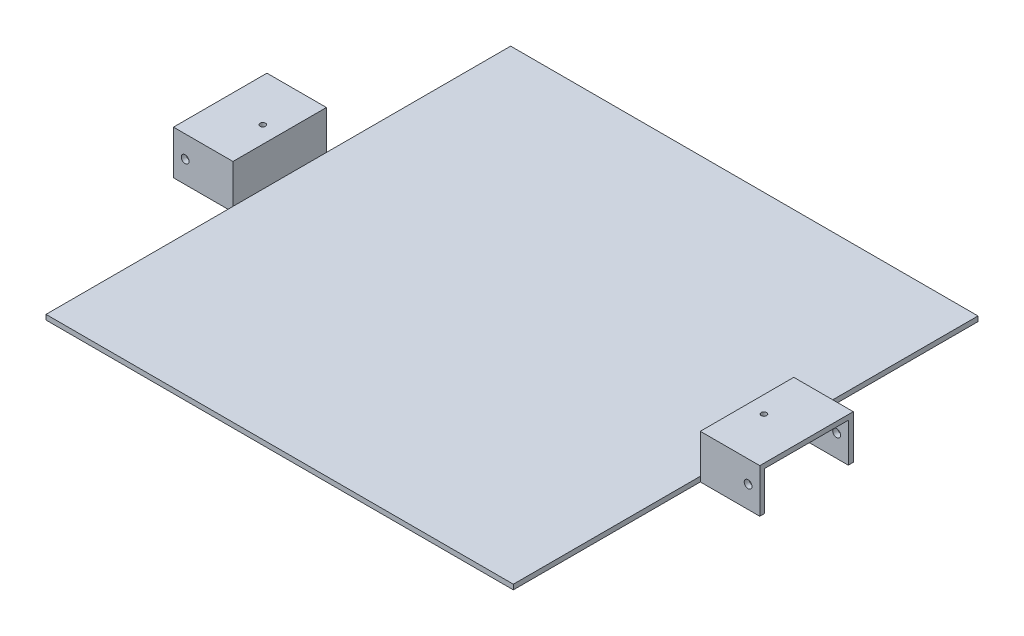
ISO-10303-21;
HEADER;
FILE_DESCRIPTION(('STEP AP214'),'2;1');
FILE_NAME('part.step','',(''),(''),'','','');
FILE_SCHEMA(('AUTOMOTIVE_DESIGN { 1 0 10303 214 1 1 1 1 }'));
ENDSEC;
DATA;
#1=APPLICATION_CONTEXT('core data for automotive mechanical design processes');
#2=APPLICATION_PROTOCOL_DEFINITION('international standard','automotive_design',2000,#1);
#3=PRODUCT_CONTEXT('',#1,'mechanical');
#4=PRODUCT('Part','Part','',(#3));
#5=PRODUCT_RELATED_PRODUCT_CATEGORY('part','',(#4));
#6=PRODUCT_DEFINITION_FORMATION('','',#4);
#7=PRODUCT_DEFINITION_CONTEXT('part definition',#1,'design');
#8=PRODUCT_DEFINITION('design','',#6,#7);
#9=PRODUCT_DEFINITION_SHAPE('','',#8);
#10=(LENGTH_UNIT() NAMED_UNIT(*) SI_UNIT(.MILLI.,.METRE.));
#11=(NAMED_UNIT(*) PLANE_ANGLE_UNIT() SI_UNIT($,.RADIAN.));
#12=(NAMED_UNIT(*) SI_UNIT($,.STERADIAN.) SOLID_ANGLE_UNIT());
#13=UNCERTAINTY_MEASURE_WITH_UNIT(LENGTH_MEASURE(1.E-05),#10,'distance_accuracy_value','');
#14=(GEOMETRIC_REPRESENTATION_CONTEXT(3) GLOBAL_UNCERTAINTY_ASSIGNED_CONTEXT((#13)) GLOBAL_UNIT_ASSIGNED_CONTEXT((#10,
#11,#12)) REPRESENTATION_CONTEXT('',''));
#15=CARTESIAN_POINT('',(0.,0.,0.));
#16=DIRECTION('',(0.,0.,1.));
#17=DIRECTION('',(1.,0.,0.));
#18=AXIS2_PLACEMENT_3D('',#15,#16,#17);
#19=CARTESIAN_POINT('',(306.35,0.,0.));
#20=DIRECTION('',(-1.,0.,0.));
#21=DIRECTION('',(0.,0.,-1.));
#22=AXIS2_PLACEMENT_3D('',#19,#20,#21);
#23=PLANE('',#22);
#24=DIRECTION('',(0.,-1.,0.));
#25=VECTOR('',#24,1.);
#26=CARTESIAN_POINT('',(306.35,43.65,53.65));
#27=LINE('',#26,#25);
#28=CARTESIAN_POINT('',(306.35,43.65,53.65));
#29=VERTEX_POINT('',#28);
#30=CARTESIAN_POINT('',(306.35,-6.34999999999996,53.65));
#31=VERTEX_POINT('',#30);
#32=EDGE_CURVE('E137',#29,#31,#27,.T.);
#33=ORIENTED_EDGE('',*,*,#32,.T.);
#34=DIRECTION('',(0.,0.,1.));
#35=VECTOR('',#34,1.);
#36=CARTESIAN_POINT('',(306.35,-6.34999999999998,-60.));
#37=LINE('',#36,#35);
#38=CARTESIAN_POINT('',(306.35,-6.34999999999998,-53.6499999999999));
#39=VERTEX_POINT('',#38);
#40=EDGE_CURVE('E170',#39,#31,#37,.T.);
#41=ORIENTED_EDGE('',*,*,#40,.F.);
#42=DIRECTION('',(0.,1.,0.));
#43=VECTOR('',#42,1.);
#44=CARTESIAN_POINT('',(306.35,43.65,-53.6499999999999));
#45=LINE('',#44,#43);
#46=CARTESIAN_POINT('',(306.35,43.65,-53.6499999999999));
#47=VERTEX_POINT('',#46);
#48=EDGE_CURVE('E159',#39,#47,#45,.T.);
#49=ORIENTED_EDGE('',*,*,#48,.T.);
#50=DIRECTION('',(0.,0.,1.));
#51=VECTOR('',#50,1.);
#52=CARTESIAN_POINT('',(306.35,43.65,-53.6499999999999));
#53=LINE('',#52,#51);
#54=EDGE_CURVE('E140',#47,#29,#53,.T.);
#55=ORIENTED_EDGE('',*,*,#54,.T.);
#56=EDGE_LOOP('',(#33,#41,#49,#55));
#57=FACE_BOUND('',#56,.T.);
#58=ADVANCED_FACE('F48',(#57),#23,.F.);
#59=CARTESIAN_POINT('',(306.35,-6.34999999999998,-60.));
#60=DIRECTION('',(0.,0.,1.));
#61=DIRECTION('',(-1.,0.,0.));
#62=AXIS2_PLACEMENT_3D('',#59,#60,#61);
#63=PLANE('',#62);
#64=CARTESIAN_POINT('',(361.35,21.825,-59.9999999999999));
#65=DIRECTION('',(0.,0.,1.));
#66=DIRECTION('',(0.,1.,0.));
#67=AXIS2_PLACEMENT_3D('',#64,#65,#66);
#68=CIRCLE('',#67,4.99999999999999);
#69=CARTESIAN_POINT('',(361.35,26.825,-59.9999999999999));
#70=VERTEX_POINT('',#69);
#71=EDGE_CURVE('E256',#70,#70,#68,.T.);
#72=ORIENTED_EDGE('',*,*,#71,.T.);
#73=EDGE_LOOP('',(#72));
#74=FACE_BOUND('',#73,.T.);
#75=DIRECTION('',(0.,-1.,0.));
#76=VECTOR('',#75,1.);
#77=CARTESIAN_POINT('',(300.,-6.34999999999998,-60.));
#78=LINE('',#77,#76);
#79=CARTESIAN_POINT('',(300.,50.,-60.));
#80=VERTEX_POINT('',#79);
#81=CARTESIAN_POINT('',(300.,-6.34999999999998,-60.));
#82=VERTEX_POINT('',#81);
#83=EDGE_CURVE('E169',#80,#82,#78,.T.);
#84=ORIENTED_EDGE('',*,*,#83,.F.);
#85=DIRECTION('',(-1.,0.,0.));
#86=VECTOR('',#85,1.);
#87=CARTESIAN_POINT('',(306.35,50.,-60.));
#88=LINE('',#87,#86);
#89=CARTESIAN_POINT('',(376.35,50.,-60.));
#90=VERTEX_POINT('',#89);
#91=EDGE_CURVE('E136',#90,#80,#88,.T.);
#92=ORIENTED_EDGE('',*,*,#91,.F.);
#93=DIRECTION('',(0.,-1.,0.));
#94=VECTOR('',#93,1.);
#95=CARTESIAN_POINT('',(376.35,50.,-60.));
#96=LINE('',#95,#94);
#97=CARTESIAN_POINT('',(376.35,-6.34999999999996,-59.9999999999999));
#98=VERTEX_POINT('',#97);
#99=EDGE_CURVE('E121',#90,#98,#96,.T.);
#100=ORIENTED_EDGE('',*,*,#99,.T.);
#101=DIRECTION('',(-1.,0.,0.));
#102=VECTOR('',#101,1.);
#103=CARTESIAN_POINT('',(306.35,-6.34999999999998,-60.));
#104=LINE('',#103,#102);
#105=EDGE_CURVE('E12',#98,#82,#104,.T.);
#106=ORIENTED_EDGE('',*,*,#105,.T.);
#107=EDGE_LOOP('',(#84,#92,#100,#106));
#108=FACE_BOUND('',#107,.T.);
#109=ADVANCED_FACE('F50',(#74,#108),#63,.F.);
#110=CARTESIAN_POINT('',(306.35,-6.34999999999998,-60.));
#111=DIRECTION('',(0.,1.,0.));
#112=DIRECTION('',(0.,0.,1.));
#113=AXIS2_PLACEMENT_3D('',#110,#111,#112);
#114=PLANE('',#113);
#115=DIRECTION('',(0.,0.,1.));
#116=VECTOR('',#115,1.);
#117=CARTESIAN_POINT('',(300.,-6.34999999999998,-60.));
#118=LINE('',#117,#116);
#119=CARTESIAN_POINT('',(300.,-6.34999999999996,60.0000000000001));
#120=VERTEX_POINT('',#119);
#121=EDGE_CURVE('E131',#82,#120,#118,.T.);
#122=ORIENTED_EDGE('',*,*,#121,.F.);
#123=ORIENTED_EDGE('',*,*,#105,.F.);
#124=DIRECTION('',(0.,0.,1.));
#125=VECTOR('',#124,1.);
#126=CARTESIAN_POINT('',(376.35,-6.34999999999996,-59.9999999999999));
#127=LINE('',#126,#125);
#128=CARTESIAN_POINT('',(376.35,-6.34999999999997,-53.6499999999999));
#129=VERTEX_POINT('',#128);
#130=EDGE_CURVE('E117',#98,#129,#127,.T.);
#131=ORIENTED_EDGE('',*,*,#130,.T.);
#132=DIRECTION('',(-1.,0.,0.));
#133=VECTOR('',#132,1.);
#134=CARTESIAN_POINT('',(376.35,-6.34999999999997,-53.6499999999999));
#135=LINE('',#134,#133);
#136=EDGE_CURVE('E167',#129,#39,#135,.T.);
#137=ORIENTED_EDGE('',*,*,#136,.T.);
#138=ORIENTED_EDGE('',*,*,#40,.T.);
#139=DIRECTION('',(-1.,0.,0.));
#140=VECTOR('',#139,1.);
#141=CARTESIAN_POINT('',(376.35,-6.34999999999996,53.6500000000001));
#142=LINE('',#141,#140);
#143=CARTESIAN_POINT('',(376.35,-6.34999999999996,53.6500000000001));
#144=VERTEX_POINT('',#143);
#145=EDGE_CURVE('E72',#144,#31,#142,.T.);
#146=ORIENTED_EDGE('',*,*,#145,.F.);
#147=DIRECTION('',(0.,0.,1.));
#148=VECTOR('',#147,1.);
#149=CARTESIAN_POINT('',(376.35,-6.34999999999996,60.0000000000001));
#150=LINE('',#149,#148);
#151=CARTESIAN_POINT('',(376.35,-6.34999999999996,60.0000000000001));
#152=VERTEX_POINT('',#151);
#153=EDGE_CURVE('E151',#144,#152,#150,.T.);
#154=ORIENTED_EDGE('',*,*,#153,.T.);
#155=DIRECTION('',(-1.,0.,0.));
#156=VECTOR('',#155,1.);
#157=CARTESIAN_POINT('',(306.35,-6.34999999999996,60.0000000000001));
#158=LINE('',#157,#156);
#159=EDGE_CURVE('E57',#152,#120,#158,.T.);
#160=ORIENTED_EDGE('',*,*,#159,.T.);
#161=EDGE_LOOP('',(#122,#123,#131,#137,#138,#146,#154,#160));
#162=FACE_BOUND('',#161,.T.);
#163=ADVANCED_FACE('F128',(#162),#114,.F.);
#164=CARTESIAN_POINT('',(306.35,-6.34999999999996,60.0000000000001));
#165=DIRECTION('',(0.,0.,-1.));
#166=DIRECTION('',(0.,1.,0.));
#167=AXIS2_PLACEMENT_3D('',#164,#165,#166);
#168=PLANE('',#167);
#169=CARTESIAN_POINT('',(361.35,21.825,60.0000000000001));
#170=DIRECTION('',(0.,0.,1.));
#171=DIRECTION('',(0.,1.,0.));
#172=AXIS2_PLACEMENT_3D('',#169,#170,#171);
#173=CIRCLE('',#172,4.99999999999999);
#174=CARTESIAN_POINT('',(361.35,26.8249999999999,60.0000000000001));
#175=VERTEX_POINT('',#174);
#176=EDGE_CURVE('E259',#175,#175,#173,.F.);
#177=ORIENTED_EDGE('',*,*,#176,.T.);
#178=EDGE_LOOP('',(#177));
#179=FACE_BOUND('',#178,.T.);
#180=DIRECTION('',(0.,1.,0.));
#181=VECTOR('',#180,1.);
#182=CARTESIAN_POINT('',(300.,-6.34999999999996,60.0000000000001));
#183=LINE('',#182,#181);
#184=CARTESIAN_POINT('',(300.,50.,60.));
#185=VERTEX_POINT('',#184);
#186=EDGE_CURVE('E175',#120,#185,#183,.T.);
#187=ORIENTED_EDGE('',*,*,#186,.F.);
#188=ORIENTED_EDGE('',*,*,#159,.F.);
#189=DIRECTION('',(0.,1.,0.));
#190=VECTOR('',#189,1.);
#191=CARTESIAN_POINT('',(376.35,50.,60.0000000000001));
#192=LINE('',#191,#190);
#193=CARTESIAN_POINT('',(376.35,50.,60.0000000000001));
#194=VERTEX_POINT('',#193);
#195=EDGE_CURVE('E154',#152,#194,#192,.T.);
#196=ORIENTED_EDGE('',*,*,#195,.T.);
#197=DIRECTION('',(-1.,0.,0.));
#198=VECTOR('',#197,1.);
#199=CARTESIAN_POINT('',(306.35,50.,60.));
#200=LINE('',#199,#198);
#201=EDGE_CURVE('E180',#194,#185,#200,.T.);
#202=ORIENTED_EDGE('',*,*,#201,.T.);
#203=EDGE_LOOP('',(#187,#188,#196,#202));
#204=FACE_BOUND('',#203,.T.);
#205=ADVANCED_FACE('F191',(#179,#204),#168,.F.);
#206=CARTESIAN_POINT('',(306.35,50.,-60.));
#207=DIRECTION('',(0.,-1.,0.));
#208=DIRECTION('',(0.,0.,-1.));
#209=AXIS2_PLACEMENT_3D('',#206,#207,#208);
#210=PLANE('',#209);
#211=CARTESIAN_POINT('',(321.675,50.,0.));
#212=DIRECTION('',(0.,-1.,0.));
#213=DIRECTION('',(0.,0.,1.));
#214=AXIS2_PLACEMENT_3D('',#211,#212,#213);
#215=CIRCLE('',#214,3.50000000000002);
#216=CARTESIAN_POINT('',(321.675,50.,3.50000000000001));
#217=VERTEX_POINT('',#216);
#218=EDGE_CURVE('E252',#217,#217,#215,.T.);
#219=ORIENTED_EDGE('',*,*,#218,.T.);
#220=EDGE_LOOP('',(#219));
#221=FACE_BOUND('',#220,.T.);
#222=DIRECTION('',(0.,0.,-1.));
#223=VECTOR('',#222,1.);
#224=CARTESIAN_POINT('',(300.,50.,-60.));
#225=LINE('',#224,#223);
#226=EDGE_CURVE('E172',#185,#80,#225,.T.);
#227=ORIENTED_EDGE('',*,*,#226,.F.);
#228=ORIENTED_EDGE('',*,*,#201,.F.);
#229=DIRECTION('',(0.,0.,-1.));
#230=VECTOR('',#229,1.);
#231=CARTESIAN_POINT('',(376.35,50.,-60.));
#232=LINE('',#231,#230);
#233=EDGE_CURVE('E157',#194,#90,#232,.T.);
#234=ORIENTED_EDGE('',*,*,#233,.T.);
#235=ORIENTED_EDGE('',*,*,#91,.T.);
#236=EDGE_LOOP('',(#227,#228,#234,#235));
#237=FACE_BOUND('',#236,.T.);
#238=ADVANCED_FACE('F190',(#221,#237),#210,.F.);
#239=CARTESIAN_POINT('',(300.,0.,0.));
#240=DIRECTION('',(-1.,0.,0.));
#241=DIRECTION('',(0.,0.,-1.));
#242=AXIS2_PLACEMENT_3D('',#239,#240,#241);
#243=PLANE('',#242);
#244=ORIENTED_EDGE('',*,*,#83,.T.);
#245=ORIENTED_EDGE('',*,*,#121,.T.);
#246=ORIENTED_EDGE('',*,*,#186,.T.);
#247=ORIENTED_EDGE('',*,*,#226,.T.);
#248=EDGE_LOOP('',(#244,#245,#246,#247));
#249=FACE_BOUND('',#248,.T.);
#250=ADVANCED_FACE('F187',(#249),#243,.T.);
#251=CARTESIAN_POINT('',(376.35,43.65,-53.6499999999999));
#252=DIRECTION('',(0.,0.,-1.));
#253=DIRECTION('',(0.,1.,0.));
#254=AXIS2_PLACEMENT_3D('',#251,#252,#253);
#255=PLANE('',#254);
#256=CARTESIAN_POINT('',(361.35,21.825,-53.6499999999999));
#257=DIRECTION('',(0.,0.,1.));
#258=DIRECTION('',(0.,1.,0.));
#259=AXIS2_PLACEMENT_3D('',#256,#257,#258);
#260=CIRCLE('',#259,4.99999999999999);
#261=CARTESIAN_POINT('',(361.35,26.825,-53.6499999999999));
#262=VERTEX_POINT('',#261);
#263=EDGE_CURVE('E143',#262,#262,#260,.T.);
#264=ORIENTED_EDGE('',*,*,#263,.F.);
#265=EDGE_LOOP('',(#264));
#266=FACE_BOUND('',#265,.T.);
#267=ORIENTED_EDGE('',*,*,#48,.F.);
#268=ORIENTED_EDGE('',*,*,#136,.F.);
#269=DIRECTION('',(0.,1.,0.));
#270=VECTOR('',#269,1.);
#271=CARTESIAN_POINT('',(376.35,43.65,-53.6499999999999));
#272=LINE('',#271,#270);
#273=CARTESIAN_POINT('',(376.35,43.65,-53.6499999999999));
#274=VERTEX_POINT('',#273);
#275=EDGE_CURVE('E124',#129,#274,#272,.T.);
#276=ORIENTED_EDGE('',*,*,#275,.T.);
#277=DIRECTION('',(-1.,0.,0.));
#278=VECTOR('',#277,1.);
#279=CARTESIAN_POINT('',(376.35,43.65,-53.6499999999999));
#280=LINE('',#279,#278);
#281=EDGE_CURVE('E165',#274,#47,#280,.T.);
#282=ORIENTED_EDGE('',*,*,#281,.T.);
#283=EDGE_LOOP('',(#267,#268,#276,#282));
#284=FACE_BOUND('',#283,.T.);
#285=ADVANCED_FACE('F211',(#266,#284),#255,.F.);
#286=CARTESIAN_POINT('',(376.35,43.65,-53.6499999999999));
#287=DIRECTION('',(0.,1.,0.));
#288=DIRECTION('',(0.,0.,1.));
#289=AXIS2_PLACEMENT_3D('',#286,#287,#288);
#290=PLANE('',#289);
#291=CARTESIAN_POINT('',(321.675,43.65,0.));
#292=DIRECTION('',(0.,-1.,0.));
#293=DIRECTION('',(0.,0.,1.));
#294=AXIS2_PLACEMENT_3D('',#291,#292,#293);
#295=CIRCLE('',#294,3.50000000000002);
#296=CARTESIAN_POINT('',(321.675,43.65,3.50000000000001));
#297=VERTEX_POINT('',#296);
#298=EDGE_CURVE('E255',#297,#297,#295,.F.);
#299=ORIENTED_EDGE('',*,*,#298,.T.);
#300=EDGE_LOOP('',(#299));
#301=FACE_BOUND('',#300,.T.);
#302=ORIENTED_EDGE('',*,*,#54,.F.);
#303=ORIENTED_EDGE('',*,*,#281,.F.);
#304=DIRECTION('',(0.,0.,1.));
#305=VECTOR('',#304,1.);
#306=CARTESIAN_POINT('',(376.35,43.65,-53.6499999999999));
#307=LINE('',#306,#305);
#308=CARTESIAN_POINT('',(376.35,43.65,53.65));
#309=VERTEX_POINT('',#308);
#310=EDGE_CURVE('E147',#274,#309,#307,.T.);
#311=ORIENTED_EDGE('',*,*,#310,.T.);
#312=DIRECTION('',(-1.,0.,0.));
#313=VECTOR('',#312,1.);
#314=CARTESIAN_POINT('',(376.35,43.65,53.65));
#315=LINE('',#314,#313);
#316=EDGE_CURVE('E64',#309,#29,#315,.T.);
#317=ORIENTED_EDGE('',*,*,#316,.T.);
#318=EDGE_LOOP('',(#302,#303,#311,#317));
#319=FACE_BOUND('',#318,.T.);
#320=ADVANCED_FACE('F217',(#301,#319),#290,.F.);
#321=CARTESIAN_POINT('',(376.35,43.65,53.65));
#322=DIRECTION('',(0.,0.,1.));
#323=DIRECTION('',(0.,-1.,0.));
#324=AXIS2_PLACEMENT_3D('',#321,#322,#323);
#325=PLANE('',#324);
#326=CARTESIAN_POINT('',(361.35,21.825,53.6500000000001));
#327=DIRECTION('',(0.,0.,-1.));
#328=DIRECTION('',(0.,-1.,0.));
#329=AXIS2_PLACEMENT_3D('',#326,#327,#328);
#330=CIRCLE('',#329,4.99999999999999);
#331=CARTESIAN_POINT('',(361.35,16.825,53.6500000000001));
#332=VERTEX_POINT('',#331);
#333=EDGE_CURVE('E52',#332,#332,#330,.T.);
#334=ORIENTED_EDGE('',*,*,#333,.F.);
#335=EDGE_LOOP('',(#334));
#336=FACE_BOUND('',#335,.T.);
#337=ORIENTED_EDGE('',*,*,#32,.F.);
#338=ORIENTED_EDGE('',*,*,#316,.F.);
#339=DIRECTION('',(0.,-1.,0.));
#340=VECTOR('',#339,1.);
#341=CARTESIAN_POINT('',(376.35,43.65,53.65));
#342=LINE('',#341,#340);
#343=EDGE_CURVE('E149',#309,#144,#342,.T.);
#344=ORIENTED_EDGE('',*,*,#343,.T.);
#345=ORIENTED_EDGE('',*,*,#145,.T.);
#346=EDGE_LOOP('',(#337,#338,#344,#345));
#347=FACE_BOUND('',#346,.T.);
#348=ADVANCED_FACE('F222',(#336,#347),#325,.F.);
#349=CARTESIAN_POINT('',(376.35,0.,0.));
#350=DIRECTION('',(1.,0.,0.));
#351=DIRECTION('',(0.,0.,1.));
#352=AXIS2_PLACEMENT_3D('',#349,#350,#351);
#353=PLANE('',#352);
#354=ORIENTED_EDGE('',*,*,#99,.F.);
#355=ORIENTED_EDGE('',*,*,#233,.F.);
#356=ORIENTED_EDGE('',*,*,#195,.F.);
#357=ORIENTED_EDGE('',*,*,#153,.F.);
#358=ORIENTED_EDGE('',*,*,#343,.F.);
#359=ORIENTED_EDGE('',*,*,#310,.F.);
#360=ORIENTED_EDGE('',*,*,#275,.F.);
#361=ORIENTED_EDGE('',*,*,#130,.F.);
#362=EDGE_LOOP('',(#354,#355,#356,#357,#358,#359,#360,#361));
#363=FACE_BOUND('',#362,.T.);
#364=ADVANCED_FACE('F119',(#363),#353,.T.);
#365=CARTESIAN_POINT('',(361.35,21.8249999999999,74.142135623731));
#366=DIRECTION('',(0.,0.,-1.));
#367=DIRECTION('',(0.,1.,0.));
#368=AXIS2_PLACEMENT_3D('',#365,#366,#367);
#369=CYLINDRICAL_SURFACE('',#368,4.99999999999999);
#370=ORIENTED_EDGE('',*,*,#176,.F.);
#371=EDGE_LOOP('',(#370));
#372=FACE_BOUND('',#371,.T.);
#373=ORIENTED_EDGE('',*,*,#333,.T.);
#374=EDGE_LOOP('',(#373));
#375=FACE_BOUND('',#374,.T.);
#376=ADVANCED_FACE('F236',(#372,#375),#369,.F.);
#377=ORIENTED_EDGE('',*,*,#71,.F.);
#378=EDGE_LOOP('',(#377));
#379=FACE_BOUND('',#378,.T.);
#380=ORIENTED_EDGE('',*,*,#263,.T.);
#381=EDGE_LOOP('',(#380));
#382=FACE_BOUND('',#381,.T.);
#383=ADVANCED_FACE('F240',(#379,#382),#369,.F.);
#384=CARTESIAN_POINT('',(321.675,-6.35100000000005,0.));
#385=DIRECTION('',(0.,1.,0.));
#386=DIRECTION('',(0.,0.,1.));
#387=AXIS2_PLACEMENT_3D('',#384,#385,#386);
#388=CYLINDRICAL_SURFACE('',#387,3.50000000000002);
#389=ORIENTED_EDGE('',*,*,#218,.F.);
#390=EDGE_LOOP('',(#389));
#391=FACE_BOUND('',#390,.T.);
#392=ORIENTED_EDGE('',*,*,#298,.F.);
#393=EDGE_LOOP('',(#392));
#394=FACE_BOUND('',#393,.T.);
#395=ADVANCED_FACE('F243',(#391,#394),#388,.F.);
#396=CLOSED_SHELL('',(#58,#109,#163,#205,#238,#250,#285,#320,#348,#364,#376,#383,#395));
#397=MANIFOLD_SOLID_BREP('B2',#396);
#398=CARTESIAN_POINT('',(-306.35,0.,0.));
#399=DIRECTION('',(1.,0.,0.));
#400=DIRECTION('',(0.,0.,-1.));
#401=AXIS2_PLACEMENT_3D('',#398,#399,#400);
#402=PLANE('',#401);
#403=DIRECTION('',(0.,-1.,0.));
#404=VECTOR('',#403,1.);
#405=CARTESIAN_POINT('',(-306.35,43.65,53.65));
#406=LINE('',#405,#404);
#407=CARTESIAN_POINT('',(-306.35,43.65,53.65));
#408=VERTEX_POINT('',#407);
#409=CARTESIAN_POINT('',(-306.35,-6.34999999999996,53.65));
#410=VERTEX_POINT('',#409);
#411=EDGE_CURVE('E390',#408,#410,#406,.T.);
#412=ORIENTED_EDGE('',*,*,#411,.F.);
#413=DIRECTION('',(0.,0.,1.));
#414=VECTOR('',#413,1.);
#415=CARTESIAN_POINT('',(-306.35,43.65,-53.6499999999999));
#416=LINE('',#415,#414);
#417=CARTESIAN_POINT('',(-306.35,43.65,-53.6499999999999));
#418=VERTEX_POINT('',#417);
#419=EDGE_CURVE('E460',#418,#408,#416,.T.);
#420=ORIENTED_EDGE('',*,*,#419,.F.);
#421=DIRECTION('',(0.,1.,0.));
#422=VECTOR('',#421,1.);
#423=CARTESIAN_POINT('',(-306.35,43.65,-53.6499999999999));
#424=LINE('',#423,#422);
#425=CARTESIAN_POINT('',(-306.35,-6.34999999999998,-53.6499999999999));
#426=VERTEX_POINT('',#425);
#427=EDGE_CURVE('E478',#426,#418,#424,.T.);
#428=ORIENTED_EDGE('',*,*,#427,.F.);
#429=DIRECTION('',(0.,0.,1.));
#430=VECTOR('',#429,1.);
#431=CARTESIAN_POINT('',(-306.35,-6.34999999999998,-60.));
#432=LINE('',#431,#430);
#433=EDGE_CURVE('E395',#426,#410,#432,.T.);
#434=ORIENTED_EDGE('',*,*,#433,.T.);
#435=EDGE_LOOP('',(#412,#420,#428,#434));
#436=FACE_BOUND('',#435,.T.);
#437=ADVANCED_FACE('F374',(#436),#402,.F.);
#438=CARTESIAN_POINT('',(-306.35,-6.34999999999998,-60.));
#439=DIRECTION('',(0.,0.,1.));
#440=DIRECTION('',(1.,0.,0.));
#441=AXIS2_PLACEMENT_3D('',#438,#439,#440);
#442=PLANE('',#441);
#443=CARTESIAN_POINT('',(-361.35,21.825,-59.9999999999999));
#444=DIRECTION('',(0.,0.,-1.));
#445=DIRECTION('',(0.,1.,0.));
#446=AXIS2_PLACEMENT_3D('',#443,#444,#445);
#447=CIRCLE('',#446,4.99999999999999);
#448=CARTESIAN_POINT('',(-361.35,26.825,-59.9999999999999));
#449=VERTEX_POINT('',#448);
#450=EDGE_CURVE('E674',#449,#449,#447,.T.);
#451=ORIENTED_EDGE('',*,*,#450,.F.);
#452=EDGE_LOOP('',(#451));
#453=FACE_BOUND('',#452,.T.);
#454=DIRECTION('',(0.,-1.,0.));
#455=VECTOR('',#454,1.);
#456=CARTESIAN_POINT('',(-300.,-6.34999999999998,-60.));
#457=LINE('',#456,#455);
#458=CARTESIAN_POINT('',(-300.,50.,-60.));
#459=VERTEX_POINT('',#458);
#460=CARTESIAN_POINT('',(-300.,-6.34999999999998,-60.));
#461=VERTEX_POINT('',#460);
#462=EDGE_CURVE('E443',#459,#461,#457,.T.);
#463=ORIENTED_EDGE('',*,*,#462,.T.);
#464=DIRECTION('',(1.,0.,0.));
#465=VECTOR('',#464,1.);
#466=CARTESIAN_POINT('',(-306.35,-6.34999999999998,-60.));
#467=LINE('',#466,#465);
#468=CARTESIAN_POINT('',(-376.35,-6.34999999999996,-59.9999999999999));
#469=VERTEX_POINT('',#468);
#470=EDGE_CURVE('E46',#469,#461,#467,.T.);
#471=ORIENTED_EDGE('',*,*,#470,.F.);
#472=DIRECTION('',(0.,-1.,0.));
#473=VECTOR('',#472,1.);
#474=CARTESIAN_POINT('',(-376.35,50.,-60.));
#475=LINE('',#474,#473);
#476=CARTESIAN_POINT('',(-376.35,50.,-60.));
#477=VERTEX_POINT('',#476);
#478=EDGE_CURVE('E441',#477,#469,#475,.T.);
#479=ORIENTED_EDGE('',*,*,#478,.F.);
#480=DIRECTION('',(1.,0.,0.));
#481=VECTOR('',#480,1.);
#482=CARTESIAN_POINT('',(-306.35,50.,-60.));
#483=LINE('',#482,#481);
#484=EDGE_CURVE('E492',#477,#459,#483,.T.);
#485=ORIENTED_EDGE('',*,*,#484,.T.);
#486=EDGE_LOOP('',(#463,#471,#479,#485));
#487=FACE_BOUND('',#486,.T.);
#488=ADVANCED_FACE('F376',(#453,#487),#442,.F.);
#489=CARTESIAN_POINT('',(-306.35,-6.34999999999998,-60.));
#490=DIRECTION('',(0.,1.,0.));
#491=DIRECTION('',(0.,0.,1.));
#492=AXIS2_PLACEMENT_3D('',#489,#490,#491);
#493=PLANE('',#492);
#494=DIRECTION('',(0.,0.,1.));
#495=VECTOR('',#494,1.);
#496=CARTESIAN_POINT('',(-300.,-6.34999999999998,-60.));
#497=LINE('',#496,#495);
#498=CARTESIAN_POINT('',(-300.,-6.34999999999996,60.0000000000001));
#499=VERTEX_POINT('',#498);
#500=EDGE_CURVE('E495',#461,#499,#497,.T.);
#501=ORIENTED_EDGE('',*,*,#500,.T.);
#502=DIRECTION('',(1.,0.,0.));
#503=VECTOR('',#502,1.);
#504=CARTESIAN_POINT('',(-306.35,-6.34999999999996,60.0000000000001));
#505=LINE('',#504,#503);
#506=CARTESIAN_POINT('',(-376.35,-6.34999999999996,60.0000000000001));
#507=VERTEX_POINT('',#506);
#508=EDGE_CURVE('E383',#507,#499,#505,.T.);
#509=ORIENTED_EDGE('',*,*,#508,.F.);
#510=DIRECTION('',(0.,0.,1.));
#511=VECTOR('',#510,1.);
#512=CARTESIAN_POINT('',(-376.35,-6.34999999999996,60.0000000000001));
#513=LINE('',#512,#511);
#514=CARTESIAN_POINT('',(-376.35,-6.34999999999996,53.6500000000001));
#515=VERTEX_POINT('',#514);
#516=EDGE_CURVE('E471',#515,#507,#513,.T.);
#517=ORIENTED_EDGE('',*,*,#516,.F.);
#518=DIRECTION('',(1.,0.,0.));
#519=VECTOR('',#518,1.);
#520=CARTESIAN_POINT('',(-376.35,-6.34999999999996,53.6500000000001));
#521=LINE('',#520,#519);
#522=EDGE_CURVE('E477',#515,#410,#521,.T.);
#523=ORIENTED_EDGE('',*,*,#522,.T.);
#524=ORIENTED_EDGE('',*,*,#433,.F.);
#525=DIRECTION('',(1.,0.,0.));
#526=VECTOR('',#525,1.);
#527=CARTESIAN_POINT('',(-376.35,-6.34999999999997,-53.6499999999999));
#528=LINE('',#527,#526);
#529=CARTESIAN_POINT('',(-376.35,-6.34999999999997,-53.6499999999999));
#530=VERTEX_POINT('',#529);
#531=EDGE_CURVE('E449',#530,#426,#528,.T.);
#532=ORIENTED_EDGE('',*,*,#531,.F.);
#533=DIRECTION('',(0.,0.,1.));
#534=VECTOR('',#533,1.);
#535=CARTESIAN_POINT('',(-376.35,-6.34999999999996,-59.9999999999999));
#536=LINE('',#535,#534);
#537=EDGE_CURVE('E446',#469,#530,#536,.T.);
#538=ORIENTED_EDGE('',*,*,#537,.F.);
#539=ORIENTED_EDGE('',*,*,#470,.T.);
#540=EDGE_LOOP('',(#501,#509,#517,#523,#524,#532,#538,#539));
#541=FACE_BOUND('',#540,.T.);
#542=ADVANCED_FACE('F447',(#541),#493,.F.);
#543=CARTESIAN_POINT('',(-306.35,-6.34999999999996,60.0000000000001));
#544=DIRECTION('',(0.,0.,-1.));
#545=DIRECTION('',(0.,1.,0.));
#546=AXIS2_PLACEMENT_3D('',#543,#544,#545);
#547=PLANE('',#546);
#548=CARTESIAN_POINT('',(-361.35,21.825,60.0000000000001));
#549=DIRECTION('',(0.,0.,-1.));
#550=DIRECTION('',(0.,1.,0.));
#551=AXIS2_PLACEMENT_3D('',#548,#549,#550);
#552=CIRCLE('',#551,4.99999999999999);
#553=CARTESIAN_POINT('',(-361.35,26.8249999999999,60.0000000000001));
#554=VERTEX_POINT('',#553);
#555=EDGE_CURVE('E677',#554,#554,#552,.F.);
#556=ORIENTED_EDGE('',*,*,#555,.F.);
#557=EDGE_LOOP('',(#556));
#558=FACE_BOUND('',#557,.T.);
#559=DIRECTION('',(0.,1.,0.));
#560=VECTOR('',#559,1.);
#561=CARTESIAN_POINT('',(-300.,-6.34999999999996,60.0000000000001));
#562=LINE('',#561,#560);
#563=CARTESIAN_POINT('',(-300.,50.,60.));
#564=VERTEX_POINT('',#563);
#565=EDGE_CURVE('E497',#499,#564,#562,.T.);
#566=ORIENTED_EDGE('',*,*,#565,.T.);
#567=DIRECTION('',(1.,0.,0.));
#568=VECTOR('',#567,1.);
#569=CARTESIAN_POINT('',(-306.35,50.,60.));
#570=LINE('',#569,#568);
#571=CARTESIAN_POINT('',(-376.35,50.,60.0000000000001));
#572=VERTEX_POINT('',#571);
#573=EDGE_CURVE('E501',#572,#564,#570,.T.);
#574=ORIENTED_EDGE('',*,*,#573,.F.);
#575=DIRECTION('',(0.,1.,0.));
#576=VECTOR('',#575,1.);
#577=CARTESIAN_POINT('',(-376.35,50.,60.0000000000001));
#578=LINE('',#577,#576);
#579=EDGE_CURVE('E474',#507,#572,#578,.T.);
#580=ORIENTED_EDGE('',*,*,#579,.F.);
#581=ORIENTED_EDGE('',*,*,#508,.T.);
#582=EDGE_LOOP('',(#566,#574,#580,#581));
#583=FACE_BOUND('',#582,.T.);
#584=ADVANCED_FACE('F508',(#558,#583),#547,.F.);
#585=CARTESIAN_POINT('',(-306.35,50.,-60.));
#586=DIRECTION('',(0.,-1.,0.));
#587=DIRECTION('',(0.,0.,-1.));
#588=AXIS2_PLACEMENT_3D('',#585,#586,#587);
#589=PLANE('',#588);
#590=CARTESIAN_POINT('',(-321.675,50.,0.));
#591=DIRECTION('',(0.,1.,0.));
#592=DIRECTION('',(0.,0.,1.));
#593=AXIS2_PLACEMENT_3D('',#590,#591,#592);
#594=CIRCLE('',#593,3.50000000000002);
#595=CARTESIAN_POINT('',(-321.675,50.,3.50000000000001));
#596=VERTEX_POINT('',#595);
#597=EDGE_CURVE('E670',#596,#596,#594,.T.);
#598=ORIENTED_EDGE('',*,*,#597,.F.);
#599=EDGE_LOOP('',(#598));
#600=FACE_BOUND('',#599,.T.);
#601=DIRECTION('',(0.,0.,-1.));
#602=VECTOR('',#601,1.);
#603=CARTESIAN_POINT('',(-300.,50.,-60.));
#604=LINE('',#603,#602);
#605=EDGE_CURVE('E493',#564,#459,#604,.T.);
#606=ORIENTED_EDGE('',*,*,#605,.T.);
#607=ORIENTED_EDGE('',*,*,#484,.F.);
#608=DIRECTION('',(0.,0.,-1.));
#609=VECTOR('',#608,1.);
#610=CARTESIAN_POINT('',(-376.35,50.,-60.));
#611=LINE('',#610,#609);
#612=EDGE_CURVE('E458',#572,#477,#611,.T.);
#613=ORIENTED_EDGE('',*,*,#612,.F.);
#614=ORIENTED_EDGE('',*,*,#573,.T.);
#615=EDGE_LOOP('',(#606,#607,#613,#614));
#616=FACE_BOUND('',#615,.T.);
#617=ADVANCED_FACE('F514',(#600,#616),#589,.F.);
#618=CARTESIAN_POINT('',(-300.,0.,0.));
#619=DIRECTION('',(1.,0.,0.));
#620=DIRECTION('',(0.,0.,-1.));
#621=AXIS2_PLACEMENT_3D('',#618,#619,#620);
#622=PLANE('',#621);
#623=ORIENTED_EDGE('',*,*,#462,.F.);
#624=ORIENTED_EDGE('',*,*,#605,.F.);
#625=ORIENTED_EDGE('',*,*,#565,.F.);
#626=ORIENTED_EDGE('',*,*,#500,.F.);
#627=EDGE_LOOP('',(#623,#624,#625,#626));
#628=FACE_BOUND('',#627,.T.);
#629=ADVANCED_FACE('F512',(#628),#622,.T.);
#630=CARTESIAN_POINT('',(-376.35,43.65,-53.6499999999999));
#631=DIRECTION('',(0.,0.,-1.));
#632=DIRECTION('',(0.,1.,0.));
#633=AXIS2_PLACEMENT_3D('',#630,#631,#632);
#634=PLANE('',#633);
#635=CARTESIAN_POINT('',(-361.35,21.825,-53.6499999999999));
#636=DIRECTION('',(0.,0.,-1.));
#637=DIRECTION('',(0.,1.,0.));
#638=AXIS2_PLACEMENT_3D('',#635,#636,#637);
#639=CIRCLE('',#638,4.99999999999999);
#640=CARTESIAN_POINT('',(-361.35,26.825,-53.6499999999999));
#641=VERTEX_POINT('',#640);
#642=EDGE_CURVE('E463',#641,#641,#639,.T.);
#643=ORIENTED_EDGE('',*,*,#642,.T.);
#644=EDGE_LOOP('',(#643));
#645=FACE_BOUND('',#644,.T.);
#646=ORIENTED_EDGE('',*,*,#427,.T.);
#647=DIRECTION('',(1.,0.,0.));
#648=VECTOR('',#647,1.);
#649=CARTESIAN_POINT('',(-376.35,43.65,-53.6499999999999));
#650=LINE('',#649,#648);
#651=CARTESIAN_POINT('',(-376.35,43.65,-53.6499999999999));
#652=VERTEX_POINT('',#651);
#653=EDGE_CURVE('E487',#652,#418,#650,.T.);
#654=ORIENTED_EDGE('',*,*,#653,.F.);
#655=DIRECTION('',(0.,1.,0.));
#656=VECTOR('',#655,1.);
#657=CARTESIAN_POINT('',(-376.35,43.65,-53.6499999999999));
#658=LINE('',#657,#656);
#659=EDGE_CURVE('E452',#530,#652,#658,.T.);
#660=ORIENTED_EDGE('',*,*,#659,.F.);
#661=ORIENTED_EDGE('',*,*,#531,.T.);
#662=EDGE_LOOP('',(#646,#654,#660,#661));
#663=FACE_BOUND('',#662,.T.);
#664=ADVANCED_FACE('F525',(#645,#663),#634,.F.);
#665=CARTESIAN_POINT('',(-376.35,43.65,-53.6499999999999));
#666=DIRECTION('',(0.,1.,0.));
#667=DIRECTION('',(0.,0.,1.));
#668=AXIS2_PLACEMENT_3D('',#665,#666,#667);
#669=PLANE('',#668);
#670=CARTESIAN_POINT('',(-321.675,43.65,0.));
#671=DIRECTION('',(0.,1.,0.));
#672=DIRECTION('',(0.,0.,1.));
#673=AXIS2_PLACEMENT_3D('',#670,#671,#672);
#674=CIRCLE('',#673,3.50000000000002);
#675=CARTESIAN_POINT('',(-321.675,43.65,3.50000000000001));
#676=VERTEX_POINT('',#675);
#677=EDGE_CURVE('E673',#676,#676,#674,.F.);
#678=ORIENTED_EDGE('',*,*,#677,.F.);
#679=EDGE_LOOP('',(#678));
#680=FACE_BOUND('',#679,.T.);
#681=ORIENTED_EDGE('',*,*,#419,.T.);
#682=DIRECTION('',(1.,0.,0.));
#683=VECTOR('',#682,1.);
#684=CARTESIAN_POINT('',(-376.35,43.65,53.65));
#685=LINE('',#684,#683);
#686=CARTESIAN_POINT('',(-376.35,43.65,53.65));
#687=VERTEX_POINT('',#686);
#688=EDGE_CURVE('E484',#687,#408,#685,.T.);
#689=ORIENTED_EDGE('',*,*,#688,.F.);
#690=DIRECTION('',(0.,0.,1.));
#691=VECTOR('',#690,1.);
#692=CARTESIAN_POINT('',(-376.35,43.65,-53.6499999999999));
#693=LINE('',#692,#691);
#694=EDGE_CURVE('E467',#652,#687,#693,.T.);
#695=ORIENTED_EDGE('',*,*,#694,.F.);
#696=ORIENTED_EDGE('',*,*,#653,.T.);
#697=EDGE_LOOP('',(#681,#689,#695,#696));
#698=FACE_BOUND('',#697,.T.);
#699=ADVANCED_FACE('F522',(#680,#698),#669,.F.);
#700=CARTESIAN_POINT('',(-376.35,43.65,53.65));
#701=DIRECTION('',(0.,0.,1.));
#702=DIRECTION('',(0.,-1.,0.));
#703=AXIS2_PLACEMENT_3D('',#700,#701,#702);
#704=PLANE('',#703);
#705=CARTESIAN_POINT('',(-361.35,21.825,53.6500000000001));
#706=DIRECTION('',(0.,0.,1.));
#707=DIRECTION('',(0.,-1.,0.));
#708=AXIS2_PLACEMENT_3D('',#705,#706,#707);
#709=CIRCLE('',#708,4.99999999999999);
#710=CARTESIAN_POINT('',(-361.35,16.825,53.6500000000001));
#711=VERTEX_POINT('',#710);
#712=EDGE_CURVE('E378',#711,#711,#709,.T.);
#713=ORIENTED_EDGE('',*,*,#712,.T.);
#714=EDGE_LOOP('',(#713));
#715=FACE_BOUND('',#714,.T.);
#716=ORIENTED_EDGE('',*,*,#411,.T.);
#717=ORIENTED_EDGE('',*,*,#522,.F.);
#718=DIRECTION('',(0.,-1.,0.));
#719=VECTOR('',#718,1.);
#720=CARTESIAN_POINT('',(-376.35,43.65,53.65));
#721=LINE('',#720,#719);
#722=EDGE_CURVE('E469',#687,#515,#721,.T.);
#723=ORIENTED_EDGE('',*,*,#722,.F.);
#724=ORIENTED_EDGE('',*,*,#688,.T.);
#725=EDGE_LOOP('',(#716,#717,#723,#724));
#726=FACE_BOUND('',#725,.T.);
#727=ADVANCED_FACE('F518',(#715,#726),#704,.F.);
#728=CARTESIAN_POINT('',(-376.35,0.,0.));
#729=DIRECTION('',(-1.,0.,0.));
#730=DIRECTION('',(0.,0.,1.));
#731=AXIS2_PLACEMENT_3D('',#728,#729,#730);
#732=PLANE('',#731);
#733=ORIENTED_EDGE('',*,*,#478,.T.);
#734=ORIENTED_EDGE('',*,*,#537,.T.);
#735=ORIENTED_EDGE('',*,*,#659,.T.);
#736=ORIENTED_EDGE('',*,*,#694,.T.);
#737=ORIENTED_EDGE('',*,*,#722,.T.);
#738=ORIENTED_EDGE('',*,*,#516,.T.);
#739=ORIENTED_EDGE('',*,*,#579,.T.);
#740=ORIENTED_EDGE('',*,*,#612,.T.);
#741=EDGE_LOOP('',(#733,#734,#735,#736,#737,#738,#739,#740));
#742=FACE_BOUND('',#741,.T.);
#743=ADVANCED_FACE('F455',(#742),#732,.T.);
#744=CARTESIAN_POINT('',(-361.35,21.8249999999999,74.142135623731));
#745=DIRECTION('',(0.,0.,-1.));
#746=DIRECTION('',(0.,1.,0.));
#747=AXIS2_PLACEMENT_3D('',#744,#745,#746);
#748=CYLINDRICAL_SURFACE('',#747,4.99999999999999);
#749=ORIENTED_EDGE('',*,*,#555,.T.);
#750=EDGE_LOOP('',(#749));
#751=FACE_BOUND('',#750,.T.);
#752=ORIENTED_EDGE('',*,*,#712,.F.);
#753=EDGE_LOOP('',(#752));
#754=FACE_BOUND('',#753,.T.);
#755=ADVANCED_FACE('F637',(#751,#754),#748,.F.);
#756=ORIENTED_EDGE('',*,*,#450,.T.);
#757=EDGE_LOOP('',(#756));
#758=FACE_BOUND('',#757,.T.);
#759=ORIENTED_EDGE('',*,*,#642,.F.);
#760=EDGE_LOOP('',(#759));
#761=FACE_BOUND('',#760,.T.);
#762=ADVANCED_FACE('F644',(#758,#761),#748,.F.);
#763=CARTESIAN_POINT('',(-321.675,-6.35100000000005,0.));
#764=DIRECTION('',(0.,1.,0.));
#765=DIRECTION('',(0.,0.,1.));
#766=AXIS2_PLACEMENT_3D('',#763,#764,#765);
#767=CYLINDRICAL_SURFACE('',#766,3.50000000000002);
#768=ORIENTED_EDGE('',*,*,#597,.T.);
#769=EDGE_LOOP('',(#768));
#770=FACE_BOUND('',#769,.T.);
#771=ORIENTED_EDGE('',*,*,#677,.T.);
#772=EDGE_LOOP('',(#771));
#773=FACE_BOUND('',#772,.T.);
#774=ADVANCED_FACE('F652',(#770,#773),#767,.F.);
#775=CLOSED_SHELL('',(#437,#488,#542,#584,#617,#629,#664,#699,#727,#743,#755,#762,#774));
#776=MANIFOLD_SOLID_BREP('B6',#775);
#777=CARTESIAN_POINT('',(-300.,-6.35,300.));
#778=DIRECTION('',(-1.,0.,0.));
#779=DIRECTION('',(0.,0.,1.));
#780=AXIS2_PLACEMENT_3D('',#777,#778,#779);
#781=PLANE('',#780);
#782=DIRECTION('',(0.,0.,1.));
#783=VECTOR('',#782,1.);
#784=CARTESIAN_POINT('',(-300.,0.,300.));
#785=LINE('',#784,#783);
#786=CARTESIAN_POINT('',(-300.,0.,-296.5));
#787=VERTEX_POINT('',#786);
#788=CARTESIAN_POINT('',(-300.,0.,300.));
#789=VERTEX_POINT('',#788);
#790=EDGE_CURVE('E755',#787,#789,#785,.T.);
#791=ORIENTED_EDGE('',*,*,#790,.F.);
#792=DIRECTION('',(0.,1.,0.));
#793=VECTOR('',#792,1.);
#794=CARTESIAN_POINT('',(-300.,-6.35,-296.5));
#795=LINE('',#794,#793);
#796=CARTESIAN_POINT('',(-300.,-6.35,-296.5));
#797=VERTEX_POINT('',#796);
#798=EDGE_CURVE('E372',#797,#787,#795,.T.);
#799=ORIENTED_EDGE('',*,*,#798,.F.);
#800=DIRECTION('',(0.,0.,1.));
#801=VECTOR('',#800,1.);
#802=CARTESIAN_POINT('',(-300.,-6.35,300.));
#803=LINE('',#802,#801);
#804=CARTESIAN_POINT('',(-300.,-6.35,300.));
#805=VERTEX_POINT('',#804);
#806=EDGE_CURVE('E749',#797,#805,#803,.T.);
#807=ORIENTED_EDGE('',*,*,#806,.T.);
#808=DIRECTION('',(0.,1.,0.));
#809=VECTOR('',#808,1.);
#810=CARTESIAN_POINT('',(-300.,-6.35,300.));
#811=LINE('',#810,#809);
#812=EDGE_CURVE('E694',#805,#789,#811,.T.);
#813=ORIENTED_EDGE('',*,*,#812,.T.);
#814=EDGE_LOOP('',(#791,#799,#807,#813));
#815=FACE_BOUND('',#814,.T.);
#816=ADVANCED_FACE('F691',(#815),#781,.T.);
#817=CARTESIAN_POINT('',(300.,-6.35,-296.5));
#818=DIRECTION('',(0.,0.,-1.));
#819=DIRECTION('',(-1.,0.,0.));
#820=AXIS2_PLACEMENT_3D('',#817,#818,#819);
#821=PLANE('',#820);
#822=DIRECTION('',(-1.,0.,0.));
#823=VECTOR('',#822,1.);
#824=CARTESIAN_POINT('',(300.,0.,-296.5));
#825=LINE('',#824,#823);
#826=CARTESIAN_POINT('',(300.,0.,-296.5));
#827=VERTEX_POINT('',#826);
#828=EDGE_CURVE('E751',#827,#787,#825,.T.);
#829=ORIENTED_EDGE('',*,*,#828,.F.);
#830=DIRECTION('',(0.,1.,0.));
#831=VECTOR('',#830,1.);
#832=CARTESIAN_POINT('',(300.,-6.35,-296.5));
#833=LINE('',#832,#831);
#834=CARTESIAN_POINT('',(300.,-6.35,-296.5));
#835=VERTEX_POINT('',#834);
#836=EDGE_CURVE('E700',#835,#827,#833,.T.);
#837=ORIENTED_EDGE('',*,*,#836,.F.);
#838=DIRECTION('',(-1.,0.,0.));
#839=VECTOR('',#838,1.);
#840=CARTESIAN_POINT('',(300.,-6.35,-296.5));
#841=LINE('',#840,#839);
#842=EDGE_CURVE('E746',#835,#797,#841,.T.);
#843=ORIENTED_EDGE('',*,*,#842,.T.);
#844=ORIENTED_EDGE('',*,*,#798,.T.);
#845=EDGE_LOOP('',(#829,#837,#843,#844));
#846=FACE_BOUND('',#845,.T.);
#847=ADVANCED_FACE('F765',(#846),#821,.T.);
#848=CARTESIAN_POINT('',(300.,-6.35,300.));
#849=DIRECTION('',(1.,0.,0.));
#850=DIRECTION('',(0.,0.,-1.));
#851=AXIS2_PLACEMENT_3D('',#848,#849,#850);
#852=PLANE('',#851);
#853=DIRECTION('',(0.,0.,-1.));
#854=VECTOR('',#853,1.);
#855=CARTESIAN_POINT('',(300.,0.,300.));
#856=LINE('',#855,#854);
#857=CARTESIAN_POINT('',(300.,0.,300.));
#858=VERTEX_POINT('',#857);
#859=EDGE_CURVE('E741',#858,#827,#856,.T.);
#860=ORIENTED_EDGE('',*,*,#859,.F.);
#861=DIRECTION('',(0.,1.,0.));
#862=VECTOR('',#861,1.);
#863=CARTESIAN_POINT('',(300.,-6.35,300.));
#864=LINE('',#863,#862);
#865=CARTESIAN_POINT('',(300.,-6.35,300.));
#866=VERTEX_POINT('',#865);
#867=EDGE_CURVE('E736',#866,#858,#864,.T.);
#868=ORIENTED_EDGE('',*,*,#867,.F.);
#869=DIRECTION('',(0.,0.,-1.));
#870=VECTOR('',#869,1.);
#871=CARTESIAN_POINT('',(300.,-6.35,300.));
#872=LINE('',#871,#870);
#873=EDGE_CURVE('E739',#866,#835,#872,.T.);
#874=ORIENTED_EDGE('',*,*,#873,.T.);
#875=ORIENTED_EDGE('',*,*,#836,.T.);
#876=EDGE_LOOP('',(#860,#868,#874,#875));
#877=FACE_BOUND('',#876,.T.);
#878=ADVANCED_FACE('F738',(#877),#852,.T.);
#879=CARTESIAN_POINT('',(300.,-6.35,300.));
#880=DIRECTION('',(0.,0.,1.));
#881=DIRECTION('',(1.,0.,0.));
#882=AXIS2_PLACEMENT_3D('',#879,#880,#881);
#883=PLANE('',#882);
#884=DIRECTION('',(1.,0.,0.));
#885=VECTOR('',#884,1.);
#886=CARTESIAN_POINT('',(300.,0.,300.));
#887=LINE('',#886,#885);
#888=EDGE_CURVE('E758',#789,#858,#887,.T.);
#889=ORIENTED_EDGE('',*,*,#888,.F.);
#890=ORIENTED_EDGE('',*,*,#812,.F.);
#891=DIRECTION('',(1.,0.,0.));
#892=VECTOR('',#891,1.);
#893=CARTESIAN_POINT('',(300.,-6.35,300.));
#894=LINE('',#893,#892);
#895=EDGE_CURVE('E745',#805,#866,#894,.T.);
#896=ORIENTED_EDGE('',*,*,#895,.T.);
#897=ORIENTED_EDGE('',*,*,#867,.T.);
#898=EDGE_LOOP('',(#889,#890,#896,#897));
#899=FACE_BOUND('',#898,.T.);
#900=ADVANCED_FACE('F748',(#899),#883,.T.);
#901=CARTESIAN_POINT('',(0.,-6.35,0.));
#902=DIRECTION('',(0.,1.,0.));
#903=DIRECTION('',(0.,0.,1.));
#904=AXIS2_PLACEMENT_3D('',#901,#902,#903);
#905=PLANE('',#904);
#906=ORIENTED_EDGE('',*,*,#806,.F.);
#907=ORIENTED_EDGE('',*,*,#842,.F.);
#908=ORIENTED_EDGE('',*,*,#873,.F.);
#909=ORIENTED_EDGE('',*,*,#895,.F.);
#910=EDGE_LOOP('',(#906,#907,#908,#909));
#911=FACE_BOUND('',#910,.T.);
#912=ADVANCED_FACE('F744',(#911),#905,.F.);
#913=CARTESIAN_POINT('',(0.,0.,0.));
#914=DIRECTION('',(0.,1.,0.));
#915=DIRECTION('',(0.,0.,1.));
#916=AXIS2_PLACEMENT_3D('',#913,#914,#915);
#917=PLANE('',#916);
#918=ORIENTED_EDGE('',*,*,#790,.T.);
#919=ORIENTED_EDGE('',*,*,#888,.T.);
#920=ORIENTED_EDGE('',*,*,#859,.T.);
#921=ORIENTED_EDGE('',*,*,#828,.T.);
#922=EDGE_LOOP('',(#918,#919,#920,#921));
#923=FACE_BOUND('',#922,.T.);
#924=ADVANCED_FACE('F764',(#923),#917,.T.);
#925=CLOSED_SHELL('',(#816,#847,#878,#900,#912,#924));
#926=MANIFOLD_SOLID_BREP('B40',#925);
#927=ADVANCED_BREP_SHAPE_REPRESENTATION('',(#18,#397,#776,#926),#14);
#928=SHAPE_DEFINITION_REPRESENTATION(#9,#927);
ENDSEC;
END-ISO-10303-21;
